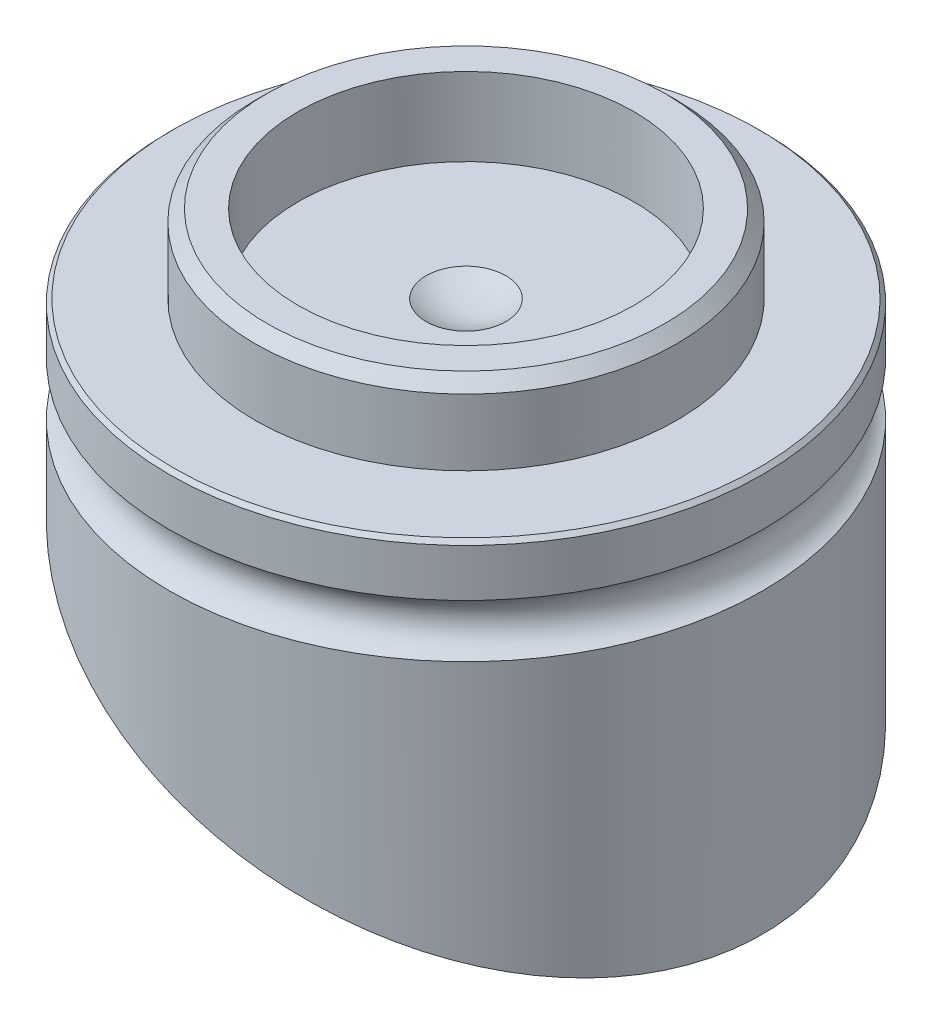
ISO-10303-21;
HEADER;
FILE_DESCRIPTION(('STEP AP214'),'2;1');
FILE_NAME('part.step','',(''),(''),'','','');
FILE_SCHEMA(('AUTOMOTIVE_DESIGN { 1 0 10303 214 1 1 1 1 }'));
ENDSEC;
DATA;
#1=APPLICATION_CONTEXT('core data for automotive mechanical design processes');
#2=APPLICATION_PROTOCOL_DEFINITION('international standard','automotive_design',2000,#1);
#3=PRODUCT_CONTEXT('',#1,'mechanical');
#4=PRODUCT('Part','Part','',(#3));
#5=PRODUCT_RELATED_PRODUCT_CATEGORY('part','',(#4));
#6=PRODUCT_DEFINITION_FORMATION('','',#4);
#7=PRODUCT_DEFINITION_CONTEXT('part definition',#1,'design');
#8=PRODUCT_DEFINITION('design','',#6,#7);
#9=PRODUCT_DEFINITION_SHAPE('','',#8);
#10=(LENGTH_UNIT() NAMED_UNIT(*) SI_UNIT(.MILLI.,.METRE.));
#11=(NAMED_UNIT(*) PLANE_ANGLE_UNIT() SI_UNIT($,.RADIAN.));
#12=(NAMED_UNIT(*) SI_UNIT($,.STERADIAN.) SOLID_ANGLE_UNIT());
#13=UNCERTAINTY_MEASURE_WITH_UNIT(LENGTH_MEASURE(1.E-05),#10,'distance_accuracy_value','');
#14=(GEOMETRIC_REPRESENTATION_CONTEXT(3) GLOBAL_UNCERTAINTY_ASSIGNED_CONTEXT((#13)) GLOBAL_UNIT_ASSIGNED_CONTEXT((#10,
#11,#12)) REPRESENTATION_CONTEXT('',''));
#15=CARTESIAN_POINT('',(0.,0.,0.));
#16=DIRECTION('',(0.,0.,1.));
#17=DIRECTION('',(1.,0.,0.));
#18=AXIS2_PLACEMENT_3D('',#15,#16,#17);
#19=CARTESIAN_POINT('',(0.,0.,0.));
#20=DIRECTION('',(0.,1.,0.));
#21=DIRECTION('',(0.,0.,1.));
#22=AXIS2_PLACEMENT_3D('',#19,#20,#21);
#23=CYLINDRICAL_SURFACE('',#22,19.);
#24=CARTESIAN_POINT('',(0.,34.75,0.));
#25=DIRECTION('',(0.,1.,0.));
#26=DIRECTION('',(0.,0.,1.));
#27=AXIS2_PLACEMENT_3D('',#24,#25,#26);
#28=CIRCLE('',#27,19.);
#29=CARTESIAN_POINT('',(0.,34.75,19.));
#30=VERTEX_POINT('',#29);
#31=EDGE_CURVE('E77',#30,#30,#28,.F.);
#32=ORIENTED_EDGE('',*,*,#31,.T.);
#33=EDGE_LOOP('',(#32));
#34=FACE_BOUND('',#33,.T.);
#35=CARTESIAN_POINT('',(0.,31.6970562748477,0.));
#36=DIRECTION('',(0.,-1.,0.));
#37=DIRECTION('',(0.,0.,-1.));
#38=AXIS2_PLACEMENT_3D('',#35,#36,#37);
#39=CIRCLE('',#38,19.);
#40=CARTESIAN_POINT('',(0.,31.6970562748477,-19.));
#41=VERTEX_POINT('',#40);
#42=EDGE_CURVE('E54',#41,#41,#39,.F.);
#43=ORIENTED_EDGE('',*,*,#42,.T.);
#44=EDGE_LOOP('',(#43));
#45=FACE_BOUND('',#44,.T.);
#46=ADVANCED_FACE('F34',(#34,#45),#23,.T.);
#47=CARTESIAN_POINT('',(0.,35.,0.));
#48=DIRECTION('',(0.,1.,0.));
#49=DIRECTION('',(0.,0.,1.));
#50=AXIS2_PLACEMENT_3D('',#47,#48,#49);
#51=PLANE('',#50);
#52=CARTESIAN_POINT('',(0.,35.,0.));
#53=DIRECTION('',(0.,1.,0.));
#54=DIRECTION('',(0.,0.,1.));
#55=AXIS2_PLACEMENT_3D('',#52,#53,#54);
#56=CIRCLE('',#55,18.75);
#57=CARTESIAN_POINT('',(0.,35.,18.75));
#58=VERTEX_POINT('',#57);
#59=EDGE_CURVE('E72',#58,#58,#56,.T.);
#60=ORIENTED_EDGE('',*,*,#59,.T.);
#61=EDGE_LOOP('',(#60));
#62=FACE_BOUND('',#61,.T.);
#63=CARTESIAN_POINT('',(0.,35.,0.));
#64=DIRECTION('',(0.,1.,0.));
#65=DIRECTION('',(0.,0.,1.));
#66=AXIS2_PLACEMENT_3D('',#63,#64,#65);
#67=CIRCLE('',#66,13.5);
#68=CARTESIAN_POINT('',(0.,35.,13.5));
#69=VERTEX_POINT('',#68);
#70=EDGE_CURVE('E65',#69,#69,#67,.T.);
#71=ORIENTED_EDGE('',*,*,#70,.F.);
#72=EDGE_LOOP('',(#71));
#73=FACE_BOUND('',#72,.T.);
#74=ADVANCED_FACE('F101',(#62,#73),#51,.T.);
#75=CARTESIAN_POINT('',(0.,35.,0.));
#76=DIRECTION('',(0.,1.,0.));
#77=DIRECTION('',(0.,0.,1.));
#78=AXIS2_PLACEMENT_3D('',#75,#76,#77);
#79=CYLINDRICAL_SURFACE('',#78,13.5);
#80=CARTESIAN_POINT('',(0.,39.25,0.));
#81=DIRECTION('',(0.,-1.,0.));
#82=DIRECTION('',(0.,0.,-1.));
#83=AXIS2_PLACEMENT_3D('',#80,#81,#82);
#84=CIRCLE('',#83,13.5);
#85=CARTESIAN_POINT('',(0.,39.25,-13.5));
#86=VERTEX_POINT('',#85);
#87=EDGE_CURVE('E11',#86,#86,#84,.T.);
#88=ORIENTED_EDGE('',*,*,#87,.T.);
#89=EDGE_LOOP('',(#88));
#90=FACE_BOUND('',#89,.T.);
#91=ORIENTED_EDGE('',*,*,#70,.T.);
#92=EDGE_LOOP('',(#91));
#93=FACE_BOUND('',#92,.T.);
#94=ADVANCED_FACE('F108',(#90,#93),#79,.T.);
#95=CARTESIAN_POINT('',(0.,35.,0.));
#96=DIRECTION('',(0.,-1.,0.));
#97=DIRECTION('',(0.,0.,-1.));
#98=AXIS2_PLACEMENT_3D('',#95,#96,#97);
#99=CONICAL_SURFACE('',#98,18.75,0.785398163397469);
#100=ORIENTED_EDGE('',*,*,#31,.F.);
#101=EDGE_LOOP('',(#100));
#102=FACE_BOUND('',#101,.T.);
#103=ORIENTED_EDGE('',*,*,#59,.F.);
#104=EDGE_LOOP('',(#103));
#105=FACE_BOUND('',#104,.T.);
#106=ADVANCED_FACE('F121',(#102,#105),#99,.T.);
#107=CARTESIAN_POINT('',(0.,30.,0.));
#108=DIRECTION('',(0.,-1.,0.));
#109=DIRECTION('',(0.,0.,-1.));
#110=AXIS2_PLACEMENT_3D('',#107,#108,#109);
#111=TOROIDAL_SURFACE('',#110,19.6,1.8);
#112=CARTESIAN_POINT('',(0.,28.3029437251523,0.));
#113=DIRECTION('',(0.,1.,0.));
#114=DIRECTION('',(0.,0.,1.));
#115=AXIS2_PLACEMENT_3D('',#112,#113,#114);
#116=CIRCLE('',#115,19.);
#117=CARTESIAN_POINT('',(0.,28.3029437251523,19.));
#118=VERTEX_POINT('',#117);
#119=EDGE_CURVE('E58',#118,#118,#116,.F.);
#120=ORIENTED_EDGE('',*,*,#119,.F.);
#121=EDGE_LOOP('',(#120));
#122=FACE_BOUND('',#121,.T.);
#123=ORIENTED_EDGE('',*,*,#42,.F.);
#124=EDGE_LOOP('',(#123));
#125=FACE_BOUND('',#124,.T.);
#126=ADVANCED_FACE('F113',(#122,#125),#111,.F.);
#127=CARTESIAN_POINT('',(0.,17.1299423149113,0.));
#128=DIRECTION('',(0.382683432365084,0.923879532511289,0.));
#129=DIRECTION('',(-0.923879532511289,0.382683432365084,0.));
#130=AXIS2_PLACEMENT_3D('',#127,#128,#129);
#131=ELLIPSE('',#130,20.5654518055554,19.);
#132=CARTESIAN_POINT('',(-19.,25.,0.));
#133=VERTEX_POINT('',#132);
#134=EDGE_CURVE('E79',#133,#133,#131,.F.);
#135=ORIENTED_EDGE('',*,*,#134,.F.);
#136=EDGE_LOOP('',(#135));
#137=FACE_BOUND('',#136,.T.);
#138=ORIENTED_EDGE('',*,*,#119,.T.);
#139=EDGE_LOOP('',(#138));
#140=FACE_BOUND('',#139,.T.);
#141=ADVANCED_FACE('F104',(#137,#140),#23,.T.);
#142=CARTESIAN_POINT('',(-19.,25.,-22.5));
#143=DIRECTION('',(0.382683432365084,0.923879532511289,0.));
#144=DIRECTION('',(-0.923879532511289,0.382683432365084,0.));
#145=AXIS2_PLACEMENT_3D('',#142,#143,#144);
#146=PLANE('',#145);
#147=CARTESIAN_POINT('',(0.,17.1299423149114,0.));
#148=DIRECTION('',(-0.382683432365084,-0.923879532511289,0.));
#149=DIRECTION('',(0.923879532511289,-0.382683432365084,0.));
#150=AXIS2_PLACEMENT_3D('',#147,#148,#149);
#151=CIRCLE('',#150,2.49999999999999);
#152=CARTESIAN_POINT('',(2.30969883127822,16.1732337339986,0.));
#153=VERTEX_POINT('',#152);
#154=EDGE_CURVE('E55',#153,#153,#151,.T.);
#155=ORIENTED_EDGE('',*,*,#154,.F.);
#156=EDGE_LOOP('',(#155));
#157=FACE_BOUND('',#156,.T.);
#158=ORIENTED_EDGE('',*,*,#134,.T.);
#159=EDGE_LOOP('',(#158));
#160=FACE_BOUND('',#159,.T.);
#161=ADVANCED_FACE('F48',(#157,#160),#146,.F.);
#162=CARTESIAN_POINT('',(6.50561835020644,32.8358943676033,0.));
#163=DIRECTION('',(-0.382683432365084,-0.923879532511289,0.));
#164=DIRECTION('',(0.923879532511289,-0.382683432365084,0.));
#165=AXIS2_PLACEMENT_3D('',#162,#163,#164);
#166=CONICAL_SURFACE('',#165,2.5,1.02974425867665);
#167=CARTESIAN_POINT('',(7.08046686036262,34.2237014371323,0.));
#168=VERTEX_POINT('',#167);
#169=VERTEX_LOOP('',#168);
#170=FACE_BOUND('',#169,.T.);
#171=CARTESIAN_POINT('',(6.50561835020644,32.8358943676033,0.));
#172=DIRECTION('',(-0.382683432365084,-0.923879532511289,0.));
#173=DIRECTION('',(0.923879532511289,-0.382683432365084,0.));
#174=AXIS2_PLACEMENT_3D('',#171,#172,#173);
#175=CIRCLE('',#174,2.5);
#176=CARTESIAN_POINT('',(8.81531718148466,31.8791857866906,0.));
#177=VERTEX_POINT('',#176);
#178=EDGE_CURVE('E52',#177,#177,#175,.T.);
#179=ORIENTED_EDGE('',*,*,#178,.T.);
#180=EDGE_LOOP('',(#179));
#181=FACE_BOUND('',#180,.T.);
#182=ADVANCED_FACE('F44',(#170,#181),#166,.F.);
#183=CARTESIAN_POINT('',(0.,17.1299423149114,0.));
#184=DIRECTION('',(-0.382683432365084,-0.923879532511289,0.));
#185=DIRECTION('',(0.923879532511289,-0.382683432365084,0.));
#186=AXIS2_PLACEMENT_3D('',#183,#184,#185);
#187=CYLINDRICAL_SURFACE('',#186,2.49999999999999);
#188=ORIENTED_EDGE('',*,*,#178,.F.);
#189=EDGE_LOOP('',(#188));
#190=FACE_BOUND('',#189,.T.);
#191=ORIENTED_EDGE('',*,*,#154,.T.);
#192=EDGE_LOOP('',(#191));
#193=FACE_BOUND('',#192,.T.);
#194=ADVANCED_FACE('F47',(#190,#193),#187,.F.);
#195=CARTESIAN_POINT('',(-13.5,40.,-15.));
#196=DIRECTION('',(0.,-1.,0.));
#197=DIRECTION('',(0.,0.,-1.));
#198=AXIS2_PLACEMENT_3D('',#195,#196,#197);
#199=PLANE('',#198);
#200=CARTESIAN_POINT('',(0.,40.,0.));
#201=DIRECTION('',(0.,-1.,0.));
#202=DIRECTION('',(0.,0.,-1.));
#203=AXIS2_PLACEMENT_3D('',#200,#201,#202);
#204=CIRCLE('',#203,12.75);
#205=CARTESIAN_POINT('',(0.,40.,-12.75));
#206=VERTEX_POINT('',#205);
#207=EDGE_CURVE('E41',#206,#206,#204,.F.);
#208=ORIENTED_EDGE('',*,*,#207,.T.);
#209=EDGE_LOOP('',(#208));
#210=FACE_BOUND('',#209,.T.);
#211=CARTESIAN_POINT('',(0.,40.,0.));
#212=DIRECTION('',(0.,-1.,0.));
#213=DIRECTION('',(0.,0.,-1.));
#214=AXIS2_PLACEMENT_3D('',#211,#212,#213);
#215=CIRCLE('',#214,10.75);
#216=CARTESIAN_POINT('',(0.,40.,-10.75));
#217=VERTEX_POINT('',#216);
#218=EDGE_CURVE('E61',#217,#217,#215,.F.);
#219=ORIENTED_EDGE('',*,*,#218,.F.);
#220=EDGE_LOOP('',(#219));
#221=FACE_BOUND('',#220,.T.);
#222=ADVANCED_FACE('F87',(#210,#221),#199,.F.);
#223=CARTESIAN_POINT('',(0.,39.3,0.));
#224=DIRECTION('',(0.,-1.,0.));
#225=DIRECTION('',(-1.,0.,0.));
#226=AXIS2_PLACEMENT_3D('',#223,#224,#225);
#227=SPHERICAL_SURFACE('',#226,5.);
#228=CARTESIAN_POINT('',(0.,35.,0.));
#229=DIRECTION('',(0.,1.,0.));
#230=DIRECTION('',(0.,0.,1.));
#231=AXIS2_PLACEMENT_3D('',#228,#229,#230);
#232=CIRCLE('',#231,2.55147016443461);
#233=CARTESIAN_POINT('',(0.,35.,2.55147016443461));
#234=VERTEX_POINT('',#233);
#235=EDGE_CURVE('E69',#234,#234,#232,.F.);
#236=ORIENTED_EDGE('',*,*,#235,.F.);
#237=EDGE_LOOP('',(#236));
#238=FACE_BOUND('',#237,.T.);
#239=ADVANCED_FACE('F135',(#238),#227,.F.);
#240=CARTESIAN_POINT('',(0.,35.,0.));
#241=DIRECTION('',(0.,1.,0.));
#242=DIRECTION('',(0.,0.,1.));
#243=AXIS2_PLACEMENT_3D('',#240,#241,#242);
#244=PLANE('',#243);
#245=CARTESIAN_POINT('',(0.,35.,0.));
#246=DIRECTION('',(0.,1.,0.));
#247=DIRECTION('',(0.,0.,1.));
#248=AXIS2_PLACEMENT_3D('',#245,#246,#247);
#249=CIRCLE('',#248,10.75);
#250=CARTESIAN_POINT('',(0.,35.,10.75));
#251=VERTEX_POINT('',#250);
#252=EDGE_CURVE('E68',#251,#251,#249,.T.);
#253=ORIENTED_EDGE('',*,*,#252,.T.);
#254=EDGE_LOOP('',(#253));
#255=FACE_BOUND('',#254,.T.);
#256=ORIENTED_EDGE('',*,*,#235,.T.);
#257=EDGE_LOOP('',(#256));
#258=FACE_BOUND('',#257,.T.);
#259=ADVANCED_FACE('F96',(#255,#258),#244,.T.);
#260=CARTESIAN_POINT('',(0.,35.,0.));
#261=DIRECTION('',(0.,1.,0.));
#262=DIRECTION('',(0.,0.,1.));
#263=AXIS2_PLACEMENT_3D('',#260,#261,#262);
#264=CYLINDRICAL_SURFACE('',#263,10.75);
#265=ORIENTED_EDGE('',*,*,#218,.T.);
#266=EDGE_LOOP('',(#265));
#267=FACE_BOUND('',#266,.T.);
#268=ORIENTED_EDGE('',*,*,#252,.F.);
#269=EDGE_LOOP('',(#268));
#270=FACE_BOUND('',#269,.T.);
#271=ADVANCED_FACE('F91',(#267,#270),#264,.F.);
#272=CARTESIAN_POINT('',(0.,40.,0.));
#273=DIRECTION('',(0.,-1.,0.));
#274=DIRECTION('',(0.,0.,-1.));
#275=AXIS2_PLACEMENT_3D('',#272,#273,#274);
#276=CONICAL_SURFACE('',#275,12.75,0.785398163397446);
#277=ORIENTED_EDGE('',*,*,#87,.F.);
#278=EDGE_LOOP('',(#277));
#279=FACE_BOUND('',#278,.T.);
#280=ORIENTED_EDGE('',*,*,#207,.F.);
#281=EDGE_LOOP('',(#280));
#282=FACE_BOUND('',#281,.T.);
#283=ADVANCED_FACE('F36',(#279,#282),#276,.T.);
#284=CLOSED_SHELL('',(#46,#74,#94,#106,#126,#141,#161,#182,#194,#222,#239,#259,#271,#283));
#285=MANIFOLD_SOLID_BREP('B2',#284);
#286=ADVANCED_BREP_SHAPE_REPRESENTATION('',(#18,#285),#14);
#287=SHAPE_DEFINITION_REPRESENTATION(#9,#286);
ENDSEC;
END-ISO-10303-21;
